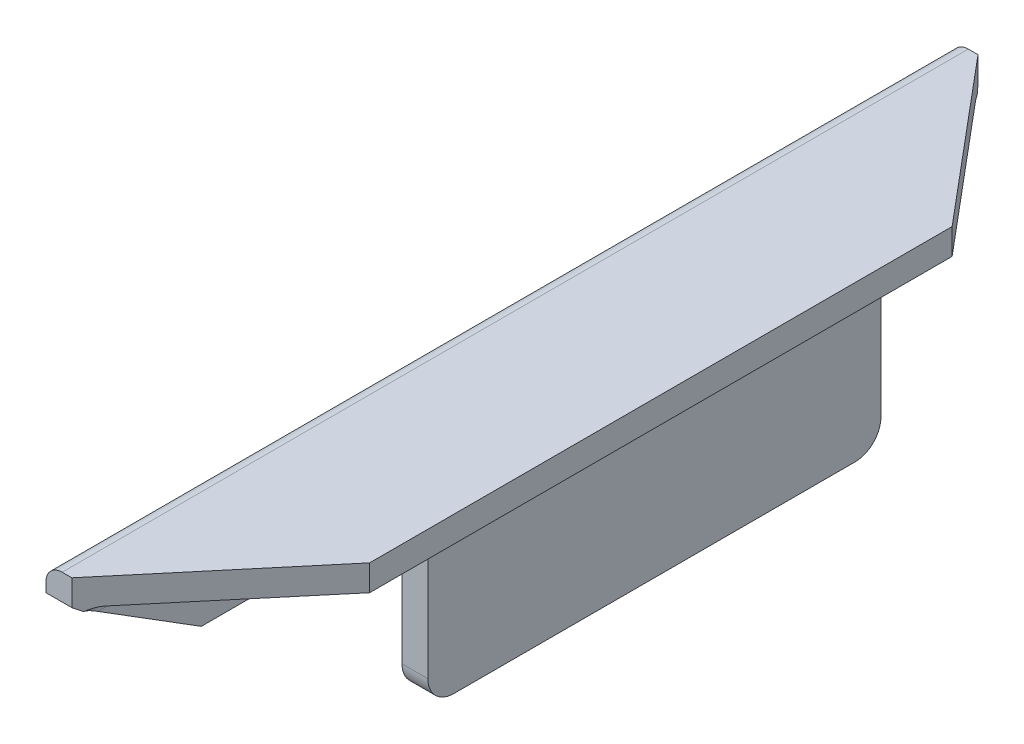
ISO-10303-21;
HEADER;
FILE_DESCRIPTION(('STEP AP214'),'2;1');
FILE_NAME('part.step','',(''),(''),'','','');
FILE_SCHEMA(('AUTOMOTIVE_DESIGN { 1 0 10303 214 1 1 1 1 }'));
ENDSEC;
DATA;
#1=APPLICATION_CONTEXT('core data for automotive mechanical design processes');
#2=APPLICATION_PROTOCOL_DEFINITION('international standard','automotive_design',2000,#1);
#3=PRODUCT_CONTEXT('',#1,'mechanical');
#4=PRODUCT('Part','Part','',(#3));
#5=PRODUCT_RELATED_PRODUCT_CATEGORY('part','',(#4));
#6=PRODUCT_DEFINITION_FORMATION('','',#4);
#7=PRODUCT_DEFINITION_CONTEXT('part definition',#1,'design');
#8=PRODUCT_DEFINITION('design','',#6,#7);
#9=PRODUCT_DEFINITION_SHAPE('','',#8);
#10=(LENGTH_UNIT() NAMED_UNIT(*) SI_UNIT(.MILLI.,.METRE.));
#11=(NAMED_UNIT(*) PLANE_ANGLE_UNIT() SI_UNIT($,.RADIAN.));
#12=(NAMED_UNIT(*) SI_UNIT($,.STERADIAN.) SOLID_ANGLE_UNIT());
#13=UNCERTAINTY_MEASURE_WITH_UNIT(LENGTH_MEASURE(1.E-05),#10,'distance_accuracy_value','');
#14=(GEOMETRIC_REPRESENTATION_CONTEXT(3) GLOBAL_UNCERTAINTY_ASSIGNED_CONTEXT((#13)) GLOBAL_UNIT_ASSIGNED_CONTEXT((#10,
#11,#12)) REPRESENTATION_CONTEXT('',''));
#15=CARTESIAN_POINT('',(0.,0.,0.));
#16=DIRECTION('',(0.,0.,1.));
#17=DIRECTION('',(1.,0.,0.));
#18=AXIS2_PLACEMENT_3D('',#15,#16,#17);
#19=CARTESIAN_POINT('',(0.,0.,280.));
#20=DIRECTION('',(1.,0.,0.));
#21=DIRECTION('',(0.,1.,0.));
#22=AXIS2_PLACEMENT_3D('',#19,#20,#21);
#23=PLANE('',#22);
#24=DIRECTION('',(0.,-1.,0.));
#25=VECTOR('',#24,1.);
#26=CARTESIAN_POINT('',(0.,0.,280.));
#27=LINE('',#26,#25);
#28=CARTESIAN_POINT('',(0.,-5.,280.));
#29=VERTEX_POINT('',#28);
#30=CARTESIAN_POINT('',(0.,-7.99999999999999,280.));
#31=VERTEX_POINT('',#30);
#32=EDGE_CURVE('E283',#29,#31,#27,.T.);
#33=ORIENTED_EDGE('',*,*,#32,.F.);
#34=DIRECTION('',(0.,0.,-1.));
#35=VECTOR('',#34,1.);
#36=CARTESIAN_POINT('',(0.,-5.,280.));
#37=LINE('',#36,#35);
#38=CARTESIAN_POINT('',(0.,-5.,0.));
#39=VERTEX_POINT('',#38);
#40=EDGE_CURVE('E216',#29,#39,#37,.T.);
#41=ORIENTED_EDGE('',*,*,#40,.T.);
#42=DIRECTION('',(0.,-1.,0.));
#43=VECTOR('',#42,1.);
#44=CARTESIAN_POINT('',(0.,0.,0.));
#45=LINE('',#44,#43);
#46=CARTESIAN_POINT('',(0.,-8.00000000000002,0.));
#47=VERTEX_POINT('',#46);
#48=EDGE_CURVE('E280',#39,#47,#45,.T.);
#49=ORIENTED_EDGE('',*,*,#48,.T.);
#50=DIRECTION('',(0.,-0.64018439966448,0.768221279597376));
#51=VECTOR('',#50,1.);
#52=CARTESIAN_POINT('',(0.,-185.829671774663,213.395606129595));
#53=LINE('',#52,#51);
#54=CARTESIAN_POINT('',(0.,-33.,30.));
#55=VERTEX_POINT('',#54);
#56=EDGE_CURVE('E267',#47,#55,#53,.T.);
#57=ORIENTED_EDGE('',*,*,#56,.T.);
#58=DIRECTION('',(0.,-1.,0.));
#59=VECTOR('',#58,1.);
#60=CARTESIAN_POINT('',(0.,-273.904399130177,30.));
#61=LINE('',#60,#59);
#62=CARTESIAN_POINT('',(0.,-81.9999999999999,30.));
#63=VERTEX_POINT('',#62);
#64=EDGE_CURVE('E257',#55,#63,#61,.T.);
#65=ORIENTED_EDGE('',*,*,#64,.T.);
#66=CARTESIAN_POINT('',(0.,-82.,38.));
#67=DIRECTION('',(-1.,0.,0.));
#68=DIRECTION('',(0.,-1.,0.));
#69=AXIS2_PLACEMENT_3D('',#66,#67,#68);
#70=CIRCLE('',#69,8.);
#71=CARTESIAN_POINT('',(0.,-90.,38.0000000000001));
#72=VERTEX_POINT('',#71);
#73=EDGE_CURVE('E253',#63,#72,#70,.T.);
#74=ORIENTED_EDGE('',*,*,#73,.T.);
#75=DIRECTION('',(0.,0.,-1.));
#76=VECTOR('',#75,1.);
#77=CARTESIAN_POINT('',(0.,-90.,280.));
#78=LINE('',#77,#76);
#79=CARTESIAN_POINT('',(0.,-90.,162.));
#80=VERTEX_POINT('',#79);
#81=EDGE_CURVE('E186',#80,#72,#78,.T.);
#82=ORIENTED_EDGE('',*,*,#81,.F.);
#83=CARTESIAN_POINT('',(0.,-82.,162.));
#84=DIRECTION('',(-1.,0.,0.));
#85=DIRECTION('',(0.,-1.,0.));
#86=AXIS2_PLACEMENT_3D('',#83,#84,#85);
#87=CIRCLE('',#86,8.);
#88=CARTESIAN_POINT('',(0.,-81.9999999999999,170.));
#89=VERTEX_POINT('',#88);
#90=EDGE_CURVE('E303',#80,#89,#87,.T.);
#91=ORIENTED_EDGE('',*,*,#90,.T.);
#92=DIRECTION('',(0.,1.,0.));
#93=VECTOR('',#92,1.);
#94=CARTESIAN_POINT('',(0.,-273.904399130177,170.));
#95=LINE('',#94,#93);
#96=CARTESIAN_POINT('',(0.,-33.,170.));
#97=VERTEX_POINT('',#96);
#98=EDGE_CURVE('E325',#89,#97,#95,.T.);
#99=ORIENTED_EDGE('',*,*,#98,.T.);
#100=DIRECTION('',(0.,0.,1.));
#101=VECTOR('',#100,1.);
#102=CARTESIAN_POINT('',(0.,-33.,140.));
#103=LINE('',#102,#101);
#104=CARTESIAN_POINT('',(0.,-33.,240.));
#105=VERTEX_POINT('',#104);
#106=EDGE_CURVE('E322',#97,#105,#103,.T.);
#107=ORIENTED_EDGE('',*,*,#106,.T.);
#108=DIRECTION('',(0.,0.52999894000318,0.847998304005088));
#109=VECTOR('',#108,1.);
#110=CARTESIAN_POINT('',(0.,-145.613595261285,59.818247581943));
#111=LINE('',#110,#109);
#112=EDGE_CURVE('E319',#105,#31,#111,.T.);
#113=ORIENTED_EDGE('',*,*,#112,.T.);
#114=EDGE_LOOP('',(#33,#41,#49,#57,#65,#74,#82,#91,#99,#107,#113));
#115=FACE_BOUND('',#114,.T.);
#116=ADVANCED_FACE('F39',(#115),#23,.F.);
#117=CARTESIAN_POINT('',(8.00000000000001,-90.,280.));
#118=DIRECTION('',(-1.,0.,0.));
#119=DIRECTION('',(0.,-1.,0.));
#120=AXIS2_PLACEMENT_3D('',#117,#118,#119);
#121=PLANE('',#120);
#122=DIRECTION('',(0.,-0.64018439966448,0.768221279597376));
#123=VECTOR('',#122,1.);
#124=CARTESIAN_POINT('',(8.00000000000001,-179.311475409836,205.573770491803));
#125=LINE('',#124,#123);
#126=CARTESIAN_POINT('',(8.00000000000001,-13.,5.99999999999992));
#127=VERTEX_POINT('',#126);
#128=CARTESIAN_POINT('',(8.00000000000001,-33.,30.));
#129=VERTEX_POINT('',#128);
#130=EDGE_CURVE('E248',#127,#129,#125,.T.);
#131=ORIENTED_EDGE('',*,*,#130,.F.);
#132=DIRECTION('',(0.,0.,-1.));
#133=VECTOR('',#132,1.);
#134=CARTESIAN_POINT('',(8.00000000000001,-13.,280.));
#135=LINE('',#134,#133);
#136=CARTESIAN_POINT('',(8.00000000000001,-13.,272.));
#137=VERTEX_POINT('',#136);
#138=EDGE_CURVE('E214',#127,#137,#135,.F.);
#139=ORIENTED_EDGE('',*,*,#138,.T.);
#140=DIRECTION('',(0.,0.52999894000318,0.847998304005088));
#141=VECTOR('',#140,1.);
#142=CARTESIAN_POINT('',(8.00000000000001,-31.0337078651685,243.14606741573));
#143=LINE('',#142,#141);
#144=CARTESIAN_POINT('',(8.00000000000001,-33.,240.));
#145=VERTEX_POINT('',#144);
#146=EDGE_CURVE('E246',#145,#137,#143,.T.);
#147=ORIENTED_EDGE('',*,*,#146,.F.);
#148=DIRECTION('',(0.,0.,1.));
#149=VECTOR('',#148,1.);
#150=CARTESIAN_POINT('',(8.00000000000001,-33.,280.));
#151=LINE('',#150,#149);
#152=CARTESIAN_POINT('',(8.00000000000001,-33.,170.));
#153=VERTEX_POINT('',#152);
#154=EDGE_CURVE('E202',#153,#145,#151,.T.);
#155=ORIENTED_EDGE('',*,*,#154,.F.);
#156=DIRECTION('',(0.,1.,0.));
#157=VECTOR('',#156,1.);
#158=CARTESIAN_POINT('',(8.00000000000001,-90.,170.));
#159=LINE('',#158,#157);
#160=CARTESIAN_POINT('',(8.00000000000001,-81.9999999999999,170.));
#161=VERTEX_POINT('',#160);
#162=EDGE_CURVE('E204',#161,#153,#159,.T.);
#163=ORIENTED_EDGE('',*,*,#162,.F.);
#164=CARTESIAN_POINT('',(8.00000000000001,-82.,162.));
#165=DIRECTION('',(-1.,0.,0.));
#166=DIRECTION('',(0.,-1.,0.));
#167=AXIS2_PLACEMENT_3D('',#164,#165,#166);
#168=CIRCLE('',#167,8.);
#169=CARTESIAN_POINT('',(8.00000000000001,-90.,162.));
#170=VERTEX_POINT('',#169);
#171=EDGE_CURVE('E206',#170,#161,#168,.T.);
#172=ORIENTED_EDGE('',*,*,#171,.F.);
#173=DIRECTION('',(0.,0.,-1.));
#174=VECTOR('',#173,1.);
#175=CARTESIAN_POINT('',(8.00000000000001,-90.,280.));
#176=LINE('',#175,#174);
#177=CARTESIAN_POINT('',(8.00000000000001,-90.,38.0000000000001));
#178=VERTEX_POINT('',#177);
#179=EDGE_CURVE('E191',#170,#178,#176,.T.);
#180=ORIENTED_EDGE('',*,*,#179,.T.);
#181=CARTESIAN_POINT('',(8.00000000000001,-82.,38.));
#182=DIRECTION('',(-1.,0.,0.));
#183=DIRECTION('',(0.,-1.,0.));
#184=AXIS2_PLACEMENT_3D('',#181,#182,#183);
#185=CIRCLE('',#184,8.);
#186=CARTESIAN_POINT('',(8.00000000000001,-81.9999999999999,30.));
#187=VERTEX_POINT('',#186);
#188=EDGE_CURVE('E196',#187,#178,#185,.T.);
#189=ORIENTED_EDGE('',*,*,#188,.F.);
#190=DIRECTION('',(0.,-1.,0.));
#191=VECTOR('',#190,1.);
#192=CARTESIAN_POINT('',(8.00000000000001,-90.,30.));
#193=LINE('',#192,#191);
#194=EDGE_CURVE('E189',#129,#187,#193,.T.);
#195=ORIENTED_EDGE('',*,*,#194,.F.);
#196=EDGE_LOOP('',(#131,#139,#147,#155,#163,#172,#180,#189,#195));
#197=FACE_BOUND('',#196,.T.);
#198=ADVANCED_FACE('F244',(#197),#121,.F.);
#199=CARTESIAN_POINT('',(50.,-90.,280.));
#200=DIRECTION('',(0.,0.,-1.));
#201=DIRECTION('',(-1.,0.,0.));
#202=AXIS2_PLACEMENT_3D('',#199,#200,#201);
#203=PLANE('',#202);
#204=DIRECTION('',(-1.,0.,0.));
#205=VECTOR('',#204,1.);
#206=CARTESIAN_POINT('',(50.,0.,280.));
#207=LINE('',#206,#205);
#208=CARTESIAN_POINT('',(7.99999999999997,0.,280.));
#209=VERTEX_POINT('',#208);
#210=CARTESIAN_POINT('',(5.,0.,280.));
#211=VERTEX_POINT('',#210);
#212=EDGE_CURVE('E179',#209,#211,#207,.T.);
#213=ORIENTED_EDGE('',*,*,#212,.T.);
#214=CARTESIAN_POINT('',(5.,-5.,280.));
#215=DIRECTION('',(0.,0.,-1.));
#216=DIRECTION('',(-1.,0.,0.));
#217=AXIS2_PLACEMENT_3D('',#214,#215,#216);
#218=CIRCLE('',#217,5.);
#219=EDGE_CURVE('E223',#211,#29,#218,.F.);
#220=ORIENTED_EDGE('',*,*,#219,.T.);
#221=ORIENTED_EDGE('',*,*,#32,.T.);
#222=DIRECTION('',(-1.,0.,0.));
#223=VECTOR('',#222,1.);
#224=CARTESIAN_POINT('',(50.,-8.00000000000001,280.));
#225=LINE('',#224,#223);
#226=CARTESIAN_POINT('',(8.00000000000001,-8.,280.));
#227=VERTEX_POINT('',#226);
#228=EDGE_CURVE('E199',#227,#31,#225,.T.);
#229=ORIENTED_EDGE('',*,*,#228,.F.);
#230=DIRECTION('',(0.,1.,0.));
#231=VECTOR('',#230,1.);
#232=CARTESIAN_POINT('',(7.99999999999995,-280.,280.));
#233=LINE('',#232,#231);
#234=EDGE_CURVE('E169',#227,#209,#233,.T.);
#235=ORIENTED_EDGE('',*,*,#234,.T.);
#236=EDGE_LOOP('',(#213,#220,#221,#229,#235));
#237=FACE_BOUND('',#236,.T.);
#238=ADVANCED_FACE('F354',(#237),#203,.F.);
#239=CARTESIAN_POINT('',(0.,-90.,280.));
#240=DIRECTION('',(0.,1.,0.));
#241=DIRECTION('',(0.,0.,1.));
#242=AXIS2_PLACEMENT_3D('',#239,#240,#241);
#243=PLANE('',#242);
#244=ORIENTED_EDGE('',*,*,#179,.F.);
#245=DIRECTION('',(-1.,0.,0.));
#246=VECTOR('',#245,1.);
#247=CARTESIAN_POINT('',(280.,-90.,162.));
#248=LINE('',#247,#246);
#249=EDGE_CURVE('E262',#170,#80,#248,.T.);
#250=ORIENTED_EDGE('',*,*,#249,.T.);
#251=ORIENTED_EDGE('',*,*,#81,.T.);
#252=DIRECTION('',(-1.,0.,0.));
#253=VECTOR('',#252,1.);
#254=CARTESIAN_POINT('',(280.,-90.,38.0000000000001));
#255=LINE('',#254,#253);
#256=EDGE_CURVE('E271',#178,#72,#255,.T.);
#257=ORIENTED_EDGE('',*,*,#256,.F.);
#258=EDGE_LOOP('',(#244,#250,#251,#257));
#259=FACE_BOUND('',#258,.T.);
#260=ADVANCED_FACE('F297',(#259),#243,.F.);
#261=CARTESIAN_POINT('',(50.,-90.,0.));
#262=DIRECTION('',(0.,0.,-1.));
#263=DIRECTION('',(-1.,0.,0.));
#264=AXIS2_PLACEMENT_3D('',#261,#262,#263);
#265=PLANE('',#264);
#266=ORIENTED_EDGE('',*,*,#48,.F.);
#267=CARTESIAN_POINT('',(5.,-5.,0.));
#268=DIRECTION('',(0.,0.,-1.));
#269=DIRECTION('',(-1.,0.,0.));
#270=AXIS2_PLACEMENT_3D('',#267,#268,#269);
#271=CIRCLE('',#270,5.);
#272=CARTESIAN_POINT('',(5.,0.,0.));
#273=VERTEX_POINT('',#272);
#274=EDGE_CURVE('E219',#39,#273,#271,.T.);
#275=ORIENTED_EDGE('',*,*,#274,.T.);
#276=DIRECTION('',(-1.,0.,0.));
#277=VECTOR('',#276,1.);
#278=CARTESIAN_POINT('',(50.,0.,0.));
#279=LINE('',#278,#277);
#280=CARTESIAN_POINT('',(7.99999999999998,0.,0.));
#281=VERTEX_POINT('',#280);
#282=EDGE_CURVE('E278',#281,#273,#279,.T.);
#283=ORIENTED_EDGE('',*,*,#282,.F.);
#284=DIRECTION('',(0.,1.,0.));
#285=VECTOR('',#284,1.);
#286=CARTESIAN_POINT('',(7.99999999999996,-280.,0.));
#287=LINE('',#286,#285);
#288=CARTESIAN_POINT('',(7.99999999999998,-8.00000000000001,0.));
#289=VERTEX_POINT('',#288);
#290=EDGE_CURVE('E312',#289,#281,#287,.T.);
#291=ORIENTED_EDGE('',*,*,#290,.F.);
#292=DIRECTION('',(-1.,0.,0.));
#293=VECTOR('',#292,1.);
#294=CARTESIAN_POINT('',(50.,-8.00000000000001,0.));
#295=LINE('',#294,#293);
#296=EDGE_CURVE('E185',#289,#47,#295,.T.);
#297=ORIENTED_EDGE('',*,*,#296,.T.);
#298=EDGE_LOOP('',(#266,#275,#283,#291,#297));
#299=FACE_BOUND('',#298,.T.);
#300=ADVANCED_FACE('F310',(#299),#265,.T.);
#301=CARTESIAN_POINT('',(50.,-8.,280.));
#302=DIRECTION('',(-1.,0.,0.));
#303=DIRECTION('',(0.,0.,1.));
#304=AXIS2_PLACEMENT_3D('',#301,#302,#303);
#305=PLANE('',#304);
#306=DIRECTION('',(0.,0.,-1.));
#307=VECTOR('',#306,1.);
#308=CARTESIAN_POINT('',(50.,0.,280.));
#309=LINE('',#308,#307);
#310=CARTESIAN_POINT('',(50.,0.,230.));
#311=VERTEX_POINT('',#310);
#312=CARTESIAN_POINT('',(50.,0.,50.));
#313=VERTEX_POINT('',#312);
#314=EDGE_CURVE('E176',#311,#313,#309,.T.);
#315=ORIENTED_EDGE('',*,*,#314,.F.);
#316=DIRECTION('',(0.,1.,0.));
#317=VECTOR('',#316,1.);
#318=CARTESIAN_POINT('',(50.,-280.,230.));
#319=LINE('',#318,#317);
#320=CARTESIAN_POINT('',(50.,-8.00000000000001,230.));
#321=VERTEX_POINT('',#320);
#322=EDGE_CURVE('E157',#321,#311,#319,.T.);
#323=ORIENTED_EDGE('',*,*,#322,.F.);
#324=DIRECTION('',(0.,0.,-1.));
#325=VECTOR('',#324,1.);
#326=CARTESIAN_POINT('',(50.,-8.,280.));
#327=LINE('',#326,#325);
#328=CARTESIAN_POINT('',(50.,-8.,50.));
#329=VERTEX_POINT('',#328);
#330=EDGE_CURVE('E285',#321,#329,#327,.T.);
#331=ORIENTED_EDGE('',*,*,#330,.T.);
#332=DIRECTION('',(0.,1.,0.));
#333=VECTOR('',#332,1.);
#334=CARTESIAN_POINT('',(50.,-280.,50.));
#335=LINE('',#334,#333);
#336=EDGE_CURVE('E184',#329,#313,#335,.T.);
#337=ORIENTED_EDGE('',*,*,#336,.T.);
#338=EDGE_LOOP('',(#315,#323,#331,#337));
#339=FACE_BOUND('',#338,.T.);
#340=ADVANCED_FACE('F182',(#339),#305,.F.);
#341=CARTESIAN_POINT('',(50.,0.,280.));
#342=DIRECTION('',(0.,-1.,0.));
#343=DIRECTION('',(1.,0.,0.));
#344=AXIS2_PLACEMENT_3D('',#341,#342,#343);
#345=PLANE('',#344);
#346=ORIENTED_EDGE('',*,*,#282,.T.);
#347=DIRECTION('',(0.,0.,-1.));
#348=VECTOR('',#347,1.);
#349=CARTESIAN_POINT('',(5.,0.,280.));
#350=LINE('',#349,#348);
#351=EDGE_CURVE('E221',#273,#211,#350,.F.);
#352=ORIENTED_EDGE('',*,*,#351,.T.);
#353=ORIENTED_EDGE('',*,*,#212,.F.);
#354=DIRECTION('',(-0.643192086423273,0.,0.765704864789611));
#355=VECTOR('',#354,1.);
#356=CARTESIAN_POINT('',(-7.59997936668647,0.,298.57140400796));
#357=LINE('',#356,#355);
#358=EDGE_CURVE('E161',#311,#209,#357,.T.);
#359=ORIENTED_EDGE('',*,*,#358,.F.);
#360=ORIENTED_EDGE('',*,*,#314,.T.);
#361=DIRECTION('',(0.643192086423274,0.,0.765704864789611));
#362=VECTOR('',#361,1.);
#363=CARTESIAN_POINT('',(-7.59997936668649,0.,-18.5714040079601));
#364=LINE('',#363,#362);
#365=EDGE_CURVE('E313',#281,#313,#364,.T.);
#366=ORIENTED_EDGE('',*,*,#365,.F.);
#367=EDGE_LOOP('',(#346,#352,#353,#359,#360,#366));
#368=FACE_BOUND('',#367,.T.);
#369=ADVANCED_FACE('F174',(#368),#345,.F.);
#370=CARTESIAN_POINT('',(8.00000000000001,-8.,280.));
#371=DIRECTION('',(0.,1.,0.));
#372=DIRECTION('',(-1.,0.,0.));
#373=AXIS2_PLACEMENT_3D('',#370,#371,#372);
#374=PLANE('',#373);
#375=DIRECTION('',(-0.643192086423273,0.,0.765704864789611));
#376=VECTOR('',#375,1.);
#377=CARTESIAN_POINT('',(8.00000000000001,-8.,280.));
#378=LINE('',#377,#376);
#379=CARTESIAN_POINT('',(13.,-8.,274.047619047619));
#380=VERTEX_POINT('',#379);
#381=EDGE_CURVE('E164',#321,#380,#378,.T.);
#382=ORIENTED_EDGE('',*,*,#381,.T.);
#383=DIRECTION('',(0.,0.,-1.));
#384=VECTOR('',#383,1.);
#385=CARTESIAN_POINT('',(13.,-8.,0.));
#386=LINE('',#385,#384);
#387=CARTESIAN_POINT('',(13.,-8.,5.9523809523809));
#388=VERTEX_POINT('',#387);
#389=EDGE_CURVE('E211',#380,#388,#386,.T.);
#390=ORIENTED_EDGE('',*,*,#389,.T.);
#391=DIRECTION('',(0.643192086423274,0.,0.765704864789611));
#392=VECTOR('',#391,1.);
#393=CARTESIAN_POINT('',(145.898686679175,-8.00000000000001,164.165103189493));
#394=LINE('',#393,#392);
#395=EDGE_CURVE('E208',#388,#329,#394,.T.);
#396=ORIENTED_EDGE('',*,*,#395,.T.);
#397=ORIENTED_EDGE('',*,*,#330,.F.);
#398=EDGE_LOOP('',(#382,#390,#396,#397));
#399=FACE_BOUND('',#398,.T.);
#400=ADVANCED_FACE('F360',(#399),#374,.F.);
#401=CARTESIAN_POINT('',(280.,-82.,38.));
#402=DIRECTION('',(-1.,0.,0.));
#403=DIRECTION('',(0.,-1.,0.));
#404=AXIS2_PLACEMENT_3D('',#401,#402,#403);
#405=CYLINDRICAL_SURFACE('',#404,8.);
#406=ORIENTED_EDGE('',*,*,#188,.T.);
#407=ORIENTED_EDGE('',*,*,#256,.T.);
#408=ORIENTED_EDGE('',*,*,#73,.F.);
#409=DIRECTION('',(-1.,0.,0.));
#410=VECTOR('',#409,1.);
#411=CARTESIAN_POINT('',(280.,-81.9999999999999,30.));
#412=LINE('',#411,#410);
#413=EDGE_CURVE('E270',#187,#63,#412,.T.);
#414=ORIENTED_EDGE('',*,*,#413,.F.);
#415=EDGE_LOOP('',(#406,#407,#408,#414));
#416=FACE_BOUND('',#415,.T.);
#417=ADVANCED_FACE('F295',(#416),#405,.T.);
#418=CARTESIAN_POINT('',(280.,-273.904399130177,30.));
#419=DIRECTION('',(0.,0.,-1.));
#420=DIRECTION('',(-1.,0.,0.));
#421=AXIS2_PLACEMENT_3D('',#418,#419,#420);
#422=PLANE('',#421);
#423=ORIENTED_EDGE('',*,*,#194,.T.);
#424=ORIENTED_EDGE('',*,*,#413,.T.);
#425=ORIENTED_EDGE('',*,*,#64,.F.);
#426=DIRECTION('',(-1.,0.,0.));
#427=VECTOR('',#426,1.);
#428=CARTESIAN_POINT('',(280.,-33.,30.));
#429=LINE('',#428,#427);
#430=EDGE_CURVE('E274',#129,#55,#429,.T.);
#431=ORIENTED_EDGE('',*,*,#430,.F.);
#432=EDGE_LOOP('',(#423,#424,#425,#431));
#433=FACE_BOUND('',#432,.T.);
#434=ADVANCED_FACE('F307',(#433),#422,.T.);
#435=CARTESIAN_POINT('',(280.,-185.829671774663,213.395606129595));
#436=DIRECTION('',(0.,-0.768221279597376,-0.64018439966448));
#437=DIRECTION('',(0.,0.64018439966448,-0.768221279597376));
#438=AXIS2_PLACEMENT_3D('',#435,#436,#437);
#439=PLANE('',#438);
#440=ORIENTED_EDGE('',*,*,#296,.F.);
#441=DIRECTION('',(0.5422126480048,-0.537909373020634,0.645491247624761));
#442=VECTOR('',#441,1.);
#443=CARTESIAN_POINT('',(76.245684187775,-75.7040517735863,81.2448621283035));
#444=LINE('',#443,#442);
#445=CARTESIAN_POINT('',(9.47030545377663,-9.45863636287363,1.75036363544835));
#446=VERTEX_POINT('',#445);
#447=EDGE_CURVE('E47',#289,#446,#444,.T.);
#448=ORIENTED_EDGE('',*,*,#447,.T.);
#449=CARTESIAN_POINT('',(13.,-13.,5.99999999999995));
#450=DIRECTION('',(0.,-0.768221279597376,-0.64018439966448));
#451=DIRECTION('',(0.,-0.64018439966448,0.768221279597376));
#452=AXIS2_PLACEMENT_3D('',#449,#450,#451);
#453=ELLIPSE('',#452,7.81024967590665,5.);
#454=EDGE_CURVE('E226',#446,#127,#453,.F.);
#455=ORIENTED_EDGE('',*,*,#454,.T.);
#456=ORIENTED_EDGE('',*,*,#130,.T.);
#457=ORIENTED_EDGE('',*,*,#430,.T.);
#458=ORIENTED_EDGE('',*,*,#56,.F.);
#459=EDGE_LOOP('',(#440,#448,#455,#456,#457,#458));
#460=FACE_BOUND('',#459,.T.);
#461=ADVANCED_FACE('F233',(#460),#439,.T.);
#462=CARTESIAN_POINT('',(280.,-82.,162.));
#463=DIRECTION('',(-1.,0.,0.));
#464=DIRECTION('',(0.,-1.,0.));
#465=AXIS2_PLACEMENT_3D('',#462,#463,#464);
#466=CYLINDRICAL_SURFACE('',#465,8.);
#467=ORIENTED_EDGE('',*,*,#171,.T.);
#468=DIRECTION('',(-1.,0.,0.));
#469=VECTOR('',#468,1.);
#470=CARTESIAN_POINT('',(280.,-81.9999999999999,170.));
#471=LINE('',#470,#469);
#472=EDGE_CURVE('E254',#161,#89,#471,.T.);
#473=ORIENTED_EDGE('',*,*,#472,.T.);
#474=ORIENTED_EDGE('',*,*,#90,.F.);
#475=ORIENTED_EDGE('',*,*,#249,.F.);
#476=EDGE_LOOP('',(#467,#473,#474,#475));
#477=FACE_BOUND('',#476,.T.);
#478=ADVANCED_FACE('F337',(#477),#466,.T.);
#479=CARTESIAN_POINT('',(280.,-273.904399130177,170.));
#480=DIRECTION('',(0.,0.,1.));
#481=DIRECTION('',(1.,0.,0.));
#482=AXIS2_PLACEMENT_3D('',#479,#480,#481);
#483=PLANE('',#482);
#484=ORIENTED_EDGE('',*,*,#162,.T.);
#485=DIRECTION('',(-1.,0.,0.));
#486=VECTOR('',#485,1.);
#487=CARTESIAN_POINT('',(280.,-32.9999999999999,170.));
#488=LINE('',#487,#486);
#489=EDGE_CURVE('E259',#153,#97,#488,.T.);
#490=ORIENTED_EDGE('',*,*,#489,.T.);
#491=ORIENTED_EDGE('',*,*,#98,.F.);
#492=ORIENTED_EDGE('',*,*,#472,.F.);
#493=EDGE_LOOP('',(#484,#490,#491,#492));
#494=FACE_BOUND('',#493,.T.);
#495=ADVANCED_FACE('F335',(#494),#483,.T.);
#496=CARTESIAN_POINT('',(280.,-32.9999999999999,140.));
#497=DIRECTION('',(0.,-1.,0.));
#498=DIRECTION('',(1.,0.,0.));
#499=AXIS2_PLACEMENT_3D('',#496,#497,#498);
#500=PLANE('',#499);
#501=ORIENTED_EDGE('',*,*,#154,.T.);
#502=DIRECTION('',(-1.,0.,0.));
#503=VECTOR('',#502,1.);
#504=CARTESIAN_POINT('',(280.,-32.9999999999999,240.));
#505=LINE('',#504,#503);
#506=EDGE_CURVE('E252',#145,#105,#505,.T.);
#507=ORIENTED_EDGE('',*,*,#506,.T.);
#508=ORIENTED_EDGE('',*,*,#106,.F.);
#509=ORIENTED_EDGE('',*,*,#489,.F.);
#510=EDGE_LOOP('',(#501,#507,#508,#509));
#511=FACE_BOUND('',#510,.T.);
#512=ADVANCED_FACE('F329',(#511),#500,.T.);
#513=CARTESIAN_POINT('',(280.,-145.613595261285,59.818247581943));
#514=DIRECTION('',(0.,-0.847998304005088,0.52999894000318));
#515=DIRECTION('',(0.,-0.52999894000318,-0.847998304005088));
#516=AXIS2_PLACEMENT_3D('',#513,#514,#515);
#517=PLANE('',#516);
#518=ORIENTED_EDGE('',*,*,#146,.T.);
#519=CARTESIAN_POINT('',(13.,-13.,272.));
#520=DIRECTION('',(0.,-0.847998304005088,0.52999894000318));
#521=DIRECTION('',(0.,0.52999894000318,0.847998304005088));
#522=AXIS2_PLACEMENT_3D('',#519,#520,#521);
#523=ELLIPSE('',#522,9.43398113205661,5.);
#524=CARTESIAN_POINT('',(9.68695357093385,-9.25517378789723,277.991721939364));
#525=VERTEX_POINT('',#524);
#526=EDGE_CURVE('E54',#137,#525,#523,.F.);
#527=ORIENTED_EDGE('',*,*,#526,.T.);
#528=DIRECTION('',(0.580176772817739,-0.431679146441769,-0.690686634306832));
#529=VECTOR('',#528,1.);
#530=CARTESIAN_POINT('',(222.253245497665,-167.414617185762,24.9366125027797));
#531=LINE('',#530,#529);
#532=EDGE_CURVE('E11',#227,#525,#531,.T.);
#533=ORIENTED_EDGE('',*,*,#532,.F.);
#534=ORIENTED_EDGE('',*,*,#228,.T.);
#535=ORIENTED_EDGE('',*,*,#112,.F.);
#536=ORIENTED_EDGE('',*,*,#506,.F.);
#537=EDGE_LOOP('',(#518,#527,#533,#534,#535,#536));
#538=FACE_BOUND('',#537,.T.);
#539=ADVANCED_FACE('F250',(#538),#517,.T.);
#540=CARTESIAN_POINT('',(-7.59997936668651,-280.,-18.5714040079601));
#541=DIRECTION('',(-0.765704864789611,0.,0.643192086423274));
#542=DIRECTION('',(0.643192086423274,0.,0.765704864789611));
#543=AXIS2_PLACEMENT_3D('',#540,#541,#542);
#544=PLANE('',#543);
#545=ORIENTED_EDGE('',*,*,#290,.T.);
#546=ORIENTED_EDGE('',*,*,#365,.T.);
#547=ORIENTED_EDGE('',*,*,#336,.F.);
#548=ORIENTED_EDGE('',*,*,#395,.F.);
#549=CARTESIAN_POINT('',(13.,-13.,5.95238095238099));
#550=DIRECTION('',(-0.765704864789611,0.,0.643192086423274));
#551=DIRECTION('',(0.643192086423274,0.,0.765704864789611));
#552=AXIS2_PLACEMENT_3D('',#549,#550,#551);
#553=ELLIPSE('',#552,7.77372748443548,5.);
#554=EDGE_CURVE('E61',#388,#446,#553,.T.);
#555=ORIENTED_EDGE('',*,*,#554,.T.);
#556=ORIENTED_EDGE('',*,*,#447,.F.);
#557=EDGE_LOOP('',(#545,#546,#547,#548,#555,#556));
#558=FACE_BOUND('',#557,.T.);
#559=ADVANCED_FACE('F367',(#558),#544,.F.);
#560=CARTESIAN_POINT('',(-7.59997936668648,-280.,298.57140400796));
#561=DIRECTION('',(-0.765704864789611,0.,-0.643192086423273));
#562=DIRECTION('',(-0.643192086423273,0.,0.765704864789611));
#563=AXIS2_PLACEMENT_3D('',#560,#561,#562);
#564=PLANE('',#563);
#565=ORIENTED_EDGE('',*,*,#322,.T.);
#566=ORIENTED_EDGE('',*,*,#358,.T.);
#567=ORIENTED_EDGE('',*,*,#234,.F.);
#568=ORIENTED_EDGE('',*,*,#532,.T.);
#569=CARTESIAN_POINT('',(13.,-13.,274.047619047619));
#570=DIRECTION('',(-0.765704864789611,0.,-0.643192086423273));
#571=DIRECTION('',(-0.643192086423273,0.,0.765704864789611));
#572=AXIS2_PLACEMENT_3D('',#569,#570,#571);
#573=ELLIPSE('',#572,7.77372748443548,5.);
#574=EDGE_CURVE('E229',#525,#380,#573,.T.);
#575=ORIENTED_EDGE('',*,*,#574,.T.);
#576=ORIENTED_EDGE('',*,*,#381,.F.);
#577=EDGE_LOOP('',(#565,#566,#567,#568,#575,#576));
#578=FACE_BOUND('',#577,.T.);
#579=ADVANCED_FACE('F159',(#578),#564,.F.);
#580=CARTESIAN_POINT('',(13.,-13.,280.));
#581=DIRECTION('',(0.,0.,1.));
#582=DIRECTION('',(1.,0.,0.));
#583=AXIS2_PLACEMENT_3D('',#580,#581,#582);
#584=CYLINDRICAL_SURFACE('',#583,5.);
#585=ORIENTED_EDGE('',*,*,#526,.F.);
#586=ORIENTED_EDGE('',*,*,#138,.F.);
#587=ORIENTED_EDGE('',*,*,#454,.F.);
#588=ORIENTED_EDGE('',*,*,#554,.F.);
#589=ORIENTED_EDGE('',*,*,#389,.F.);
#590=ORIENTED_EDGE('',*,*,#574,.F.);
#591=EDGE_LOOP('',(#585,#586,#587,#588,#589,#590));
#592=FACE_BOUND('',#591,.T.);
#593=ADVANCED_FACE('F239',(#592),#584,.F.);
#594=CARTESIAN_POINT('',(5.,-5.,280.));
#595=DIRECTION('',(0.,0.,-1.));
#596=DIRECTION('',(-1.,0.,0.));
#597=AXIS2_PLACEMENT_3D('',#594,#595,#596);
#598=CYLINDRICAL_SURFACE('',#597,5.);
#599=ORIENTED_EDGE('',*,*,#219,.F.);
#600=ORIENTED_EDGE('',*,*,#351,.F.);
#601=ORIENTED_EDGE('',*,*,#274,.F.);
#602=ORIENTED_EDGE('',*,*,#40,.F.);
#603=EDGE_LOOP('',(#599,#600,#601,#602));
#604=FACE_BOUND('',#603,.T.);
#605=ADVANCED_FACE('F41',(#604),#598,.T.);
#606=CLOSED_SHELL('',(#116,#198,#238,#260,#300,#340,#369,#400,#417,#434,#461,#478,#495,#512,
#539,#559,#579,#593,#605));
#607=MANIFOLD_SOLID_BREP('B2',#606);
#608=ADVANCED_BREP_SHAPE_REPRESENTATION('',(#18,#607),#14);
#609=SHAPE_DEFINITION_REPRESENTATION(#9,#608);
ENDSEC;
END-ISO-10303-21;
